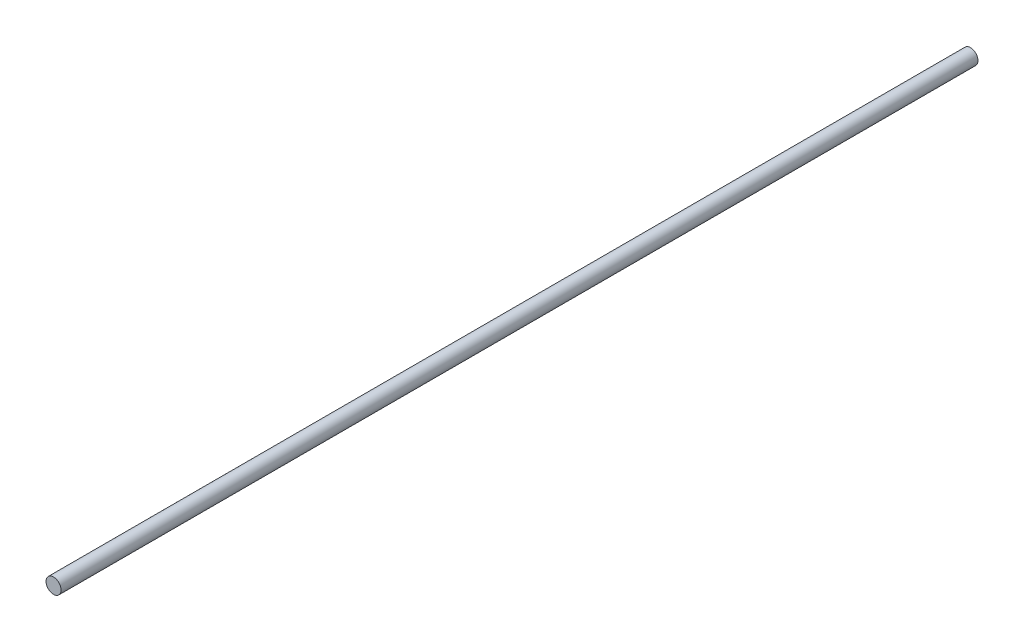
from build123d import *

# Parameters (mm, degrees)
SKETCH1_R           = 30
BOSS_EXTRUDE1_DEPTH = 3650


with BuildPart() as part:
    # Sketch1 → Boss-Extrude1 (new body)
    with BuildSketch(Plane.XY):
        Circle(SKETCH1_R)
    extrude(amount=-BOSS_EXTRUDE1_DEPTH)


solid = part.part
